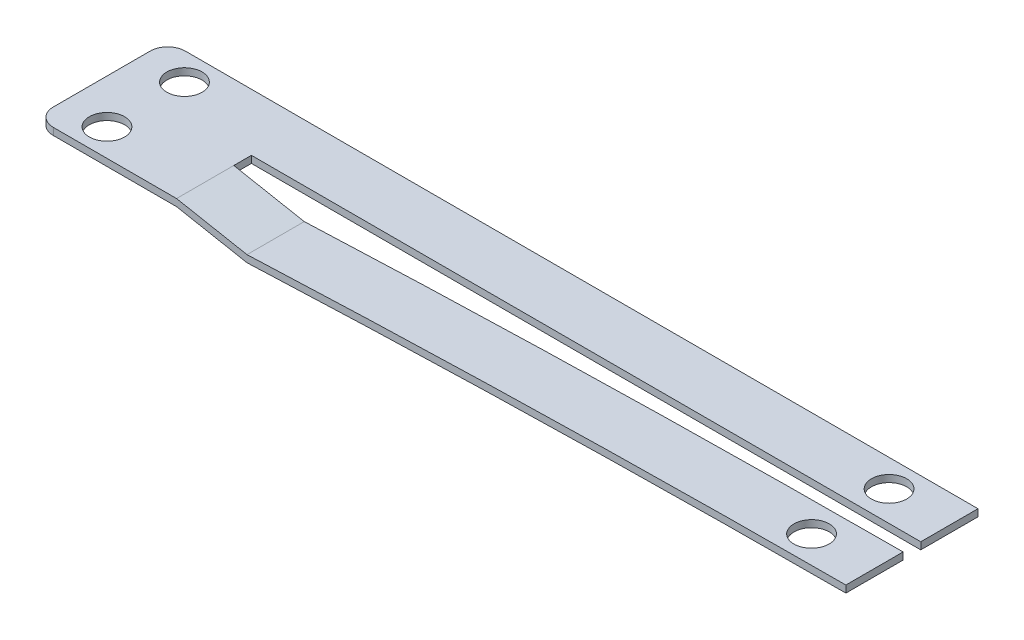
ISO-10303-21;
HEADER;
FILE_DESCRIPTION(('STEP AP214'),'2;1');
FILE_NAME('part.step','',(''),(''),'','','');
FILE_SCHEMA(('AUTOMOTIVE_DESIGN { 1 0 10303 214 1 1 1 1 }'));
ENDSEC;
DATA;
#1=APPLICATION_CONTEXT('core data for automotive mechanical design processes');
#2=APPLICATION_PROTOCOL_DEFINITION('international standard','automotive_design',2000,#1);
#3=PRODUCT_CONTEXT('',#1,'mechanical');
#4=PRODUCT('Part','Part','',(#3));
#5=PRODUCT_RELATED_PRODUCT_CATEGORY('part','',(#4));
#6=PRODUCT_DEFINITION_FORMATION('','',#4);
#7=PRODUCT_DEFINITION_CONTEXT('part definition',#1,'design');
#8=PRODUCT_DEFINITION('design','',#6,#7);
#9=PRODUCT_DEFINITION_SHAPE('','',#8);
#10=(LENGTH_UNIT() NAMED_UNIT(*) SI_UNIT(.MILLI.,.METRE.));
#11=(NAMED_UNIT(*) PLANE_ANGLE_UNIT() SI_UNIT($,.RADIAN.));
#12=(NAMED_UNIT(*) SI_UNIT($,.STERADIAN.) SOLID_ANGLE_UNIT());
#13=UNCERTAINTY_MEASURE_WITH_UNIT(LENGTH_MEASURE(1.E-05),#10,'distance_accuracy_value','');
#14=(GEOMETRIC_REPRESENTATION_CONTEXT(3) GLOBAL_UNCERTAINTY_ASSIGNED_CONTEXT((#13)) GLOBAL_UNIT_ASSIGNED_CONTEXT((#10,
#11,#12)) REPRESENTATION_CONTEXT('',''));
#15=CARTESIAN_POINT('',(0.,0.,0.));
#16=DIRECTION('',(0.,0.,1.));
#17=DIRECTION('',(1.,0.,0.));
#18=AXIS2_PLACEMENT_3D('',#15,#16,#17);
#19=CARTESIAN_POINT('',(5.16176470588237,-0.759074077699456,-7.39558823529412));
#20=DIRECTION('',(0.,1.,0.));
#21=DIRECTION('',(0.,0.,1.));
#22=AXIS2_PLACEMENT_3D('',#19,#20,#21);
#23=CYLINDRICAL_SURFACE('',#22,0.999999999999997);
#24=CARTESIAN_POINT('',(5.16176470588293,-0.0137757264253,-8.39558823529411));
#25=CARTESIAN_POINT('',(5.21790328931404,-0.0134365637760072,-8.39558361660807));
#26=CARTESIAN_POINT('',(5.27409285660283,-0.0131028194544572,-8.39084352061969));
#27=CARTESIAN_POINT('',(5.38497289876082,-0.012455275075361,-8.371985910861));
#28=CARTESIAN_POINT('',(5.43965990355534,-0.0121415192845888,-8.35784832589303));
#29=CARTESIAN_POINT('',(5.54584306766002,-0.0115422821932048,-8.32059892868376));
#30=CARTESIAN_POINT('',(5.5973418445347,-0.0112567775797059,-8.29749459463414));
#31=CARTESIAN_POINT('',(5.69570309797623,-0.0107198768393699,-8.24297877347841));
#32=CARTESIAN_POINT('',(5.74256775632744,-0.0104684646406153,-8.211571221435));
#33=CARTESIAN_POINT('',(5.83036917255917,-0.0100039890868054,-8.14132893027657));
#34=CARTESIAN_POINT('',(5.87130484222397,-0.00979093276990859,-8.10249283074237));
#35=CARTESIAN_POINT('',(5.94607853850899,-0.00940637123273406,-8.01849577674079));
#36=CARTESIAN_POINT('',(5.97991595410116,-0.0092348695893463,-7.97333427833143));
#37=CARTESIAN_POINT('',(6.03952660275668,-0.00893553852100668,-7.87797360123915));
#38=CARTESIAN_POINT('',(6.06530025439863,-0.00880770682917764,-7.82777468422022));
#39=CARTESIAN_POINT('',(6.10805378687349,-0.00859698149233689,-7.72376277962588));
#40=CARTESIAN_POINT('',(6.12503376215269,-0.00851408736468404,-7.66994983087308));
#41=CARTESIAN_POINT('',(6.1497182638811,-0.00839392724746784,-7.56023724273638));
#42=CARTESIAN_POINT('',(6.15742283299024,-0.00835666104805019,-7.50433761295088));
#43=CARTESIAN_POINT('',(6.16333793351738,-0.00832803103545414,-7.39203826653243));
#44=CARTESIAN_POINT('',(6.1615484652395,-0.00833666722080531,-7.33563854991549));
#45=CARTESIAN_POINT('',(6.14852636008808,-0.00839977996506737,-7.22394059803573));
#46=CARTESIAN_POINT('',(6.13729381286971,-0.0084542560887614,-7.16864235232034));
#47=CARTESIAN_POINT('',(6.10570436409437,-0.00860863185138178,-7.06071594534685));
#48=CARTESIAN_POINT('',(6.08534736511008,-0.00870853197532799,-7.00808781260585));
#49=CARTESIAN_POINT('',(6.03608596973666,-0.00895287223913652,-6.90699420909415));
#50=CARTESIAN_POINT('',(6.00718123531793,-0.00909731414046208,-6.85852890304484));
#51=CARTESIAN_POINT('',(5.9416479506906,-0.00942916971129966,-6.76714310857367));
#52=CARTESIAN_POINT('',(5.90502006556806,-0.00961657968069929,-6.72422214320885));
#53=CARTESIAN_POINT('',(5.82508683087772,-0.0100318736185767,-6.64514569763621));
#54=CARTESIAN_POINT('',(5.78178272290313,-0.010259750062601,-6.60898896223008));
#55=CARTESIAN_POINT('',(5.68969649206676,-0.0107525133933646,-6.54444172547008));
#56=CARTESIAN_POINT('',(5.64091178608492,-0.0110174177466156,-6.51605490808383));
#57=CARTESIAN_POINT('',(5.53923254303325,-0.0115793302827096,-6.46785542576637));
#58=CARTESIAN_POINT('',(5.48633456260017,-0.011876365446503,-6.44805003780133));
#59=CARTESIAN_POINT('',(5.37805141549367,-0.0124953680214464,-6.41764617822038));
#60=CARTESIAN_POINT('',(5.32267180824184,-0.0128172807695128,-6.4070281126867));
#61=CARTESIAN_POINT('',(5.23194154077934,-0.0133539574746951,-6.39743349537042));
#62=CARTESIAN_POINT('',(5.19686307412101,-0.013563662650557,-6.39558534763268));
#63=CARTESIAN_POINT('',(5.10562560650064,-0.0141149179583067,-6.39559285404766));
#64=CARTESIAN_POINT('',(5.04943559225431,-0.0144601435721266,-6.4003330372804));
#65=CARTESIAN_POINT('',(4.93855481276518,-0.0151524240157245,-6.41919092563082));
#66=CARTESIAN_POINT('',(4.88386751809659,-0.0154994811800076,-6.43332870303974));
#67=CARTESIAN_POINT('',(4.7776839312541,-0.0161833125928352,-6.47057852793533));
#68=CARTESIAN_POINT('',(4.72618502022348,-0.0165200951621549,-6.49368309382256));
#69=CARTESIAN_POINT('',(4.62782358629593,-0.0171717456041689,-6.5481994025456));
#70=CARTESIAN_POINT('',(4.58095888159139,-0.0174866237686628,-6.57960721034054));
#71=CARTESIAN_POINT('',(4.49315719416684,-0.0180831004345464,-6.64985023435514));
#72=CARTESIAN_POINT('',(4.45222133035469,-0.0183646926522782,-6.68868684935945));
#73=CARTESIAN_POINT('',(4.37744736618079,-0.0188836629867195,-6.77268506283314));
#74=CARTESIAN_POINT('',(4.3436098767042,-0.019121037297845,-6.81784720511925));
#75=CARTESIAN_POINT('',(4.28399940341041,-0.0195420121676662,-6.91320903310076));
#76=CARTESIAN_POINT('',(4.25822595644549,-0.0197256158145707,-6.9634084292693));
#77=CARTESIAN_POINT('',(4.21547294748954,-0.0200315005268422,-7.06742134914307));
#78=CARTESIAN_POINT('',(4.19849329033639,-0.0201537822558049,-7.12123483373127));
#79=CARTESIAN_POINT('',(4.17380974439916,-0.0203318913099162,-7.23094775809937));
#80=CARTESIAN_POINT('',(4.16610568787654,-0.0203877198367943,-7.286847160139));
#81=CARTESIAN_POINT('',(4.1601915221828,-0.0204305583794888,-7.39914598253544));
#82=CARTESIAN_POINT('',(4.16198141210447,-0.0204175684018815,-7.45554540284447));
#83=CARTESIAN_POINT('',(4.17500419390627,-0.0203233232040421,-7.56724218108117));
#84=CARTESIAN_POINT('',(4.18623691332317,-0.0202420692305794,-7.62253955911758));
#85=CARTESIAN_POINT('',(4.21782640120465,-0.020014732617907,-7.73046419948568));
#86=CARTESIAN_POINT('',(4.23818326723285,-0.0198686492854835,-7.78309143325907));
#87=CARTESIAN_POINT('',(4.28744417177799,-0.0195177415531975,-7.8841834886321));
#88=CARTESIAN_POINT('',(4.31634858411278,-0.0193129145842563,-7.93264812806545));
#89=CARTESIAN_POINT('',(4.38188096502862,-0.018852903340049,-8.02403267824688));
#90=CARTESIAN_POINT('',(4.41850826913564,-0.0185977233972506,-8.06695306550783));
#91=CARTESIAN_POINT('',(4.49844065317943,-0.0180471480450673,-8.1460290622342));
#92=CARTESIAN_POINT('',(4.54174457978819,-0.017751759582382,-8.18218583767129));
#93=CARTESIAN_POINT('',(4.63383044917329,-0.0171317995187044,-8.24673320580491));
#94=CARTESIAN_POINT('',(4.68261497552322,-0.0168072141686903,-8.27512011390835));
#95=CARTESIAN_POINT('',(4.78429442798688,-0.0161404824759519,-8.32332008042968));
#96=CARTESIAN_POINT('',(4.83719283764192,-0.0157983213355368,-8.34312577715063));
#97=CARTESIAN_POINT('',(4.94547700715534,-0.0151088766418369,-8.37353010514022));
#98=CARTESIAN_POINT('',(5.00085720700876,-0.0147616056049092,-8.38414833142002));
#99=CARTESIAN_POINT('',(5.09158802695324,-0.0142019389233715,-8.39374298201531));
#100=CARTESIAN_POINT('',(5.12666640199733,-0.0139877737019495,-8.3955911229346));
#101=CARTESIAN_POINT('',(5.16176470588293,-0.0137757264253,-8.39558823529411));
#102=B_SPLINE_CURVE_WITH_KNOTS('',3,(#24,#25,#26,#27,#28,#29,#30,#31,#32,#33,#34,#35,#36,#37,
#38,#39,#40,#41,#42,#43,#44,#45,#46,#47,#48,#49,#50,#51,#52,#53,#54,#55,#56,#57,#58,#59,#60,#61,
#62,#63,#64,#65,#66,#67,#68,#69,#70,#71,#72,#73,#74,#75,#76,#77,#78,#79,#80,#81,#82,#83,#84,#85,
#86,#87,#88,#89,#90,#91,#92,#93,#94,#95,#96,#97,#98,#99,#100,#101),.UNSPECIFIED.,.T.,.F.,(4,2,2,
2,2,2,2,2,2,2,2,2,2,2,2,2,2,2,2,2,2,2,2,2,2,2,2,2,2,2,2,2,2,2,2,2,2,2,4),(0.,0.16830879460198,
0.336978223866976,0.505507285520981,0.673956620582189,0.842436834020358,1.01093154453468,
1.1794175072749,1.34790166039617,1.5163850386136,1.68486841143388,1.85335018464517,
2.02183375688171,2.19032399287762,2.35879972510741,2.52724416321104,2.69576832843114,
2.86443512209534,3.0327413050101,3.13796953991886,3.30627988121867,3.4749508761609,
3.64348143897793,3.8119322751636,3.98041486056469,4.14891193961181,4.31739933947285,
4.48588491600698,4.65436744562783,4.82284995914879,4.99132939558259,5.15981063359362,
5.32829924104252,5.49677335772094,5.66521840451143,5.83374319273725,6.00241227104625,
6.17072071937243,6.27594876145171),.UNSPECIFIED.);
#103=CARTESIAN_POINT('',(5.16176470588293,-0.0137757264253,-8.39558823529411));
#104=VERTEX_POINT('',#103);
#105=EDGE_CURVE('E141',#104,#104,#102,.T.);
#106=ORIENTED_EDGE('',*,*,#105,.T.);
#107=EDGE_LOOP('',(#106));
#108=FACE_BOUND('',#107,.T.);
#109=CARTESIAN_POINT('',(5.16176470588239,0.386224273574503,-6.39558823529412));
#110=CARTESIAN_POINT('',(5.10562560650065,0.385885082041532,-6.39559285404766));
#111=CARTESIAN_POINT('',(5.04943559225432,0.385539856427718,-6.4003330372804));
#112=CARTESIAN_POINT('',(4.93855481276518,0.384847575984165,-6.41919092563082));
#113=CARTESIAN_POINT('',(4.88386751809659,0.384500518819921,-6.43332870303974));
#114=CARTESIAN_POINT('',(4.7776839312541,0.383816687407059,-6.47057852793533));
#115=CARTESIAN_POINT('',(4.72618502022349,0.383479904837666,-6.49368309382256));
#116=CARTESIAN_POINT('',(4.62782358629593,0.382828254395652,-6.54819940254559));
#117=CARTESIAN_POINT('',(4.58095888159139,0.382513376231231,-6.57960721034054));
#118=CARTESIAN_POINT('',(4.49315719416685,0.381916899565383,-6.64985023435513));
#119=CARTESIAN_POINT('',(4.45222133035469,0.381635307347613,-6.68868684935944));
#120=CARTESIAN_POINT('',(4.37744736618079,0.381116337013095,-6.77268506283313));
#121=CARTESIAN_POINT('',(4.34360987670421,0.380878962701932,-6.81784720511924));
#122=CARTESIAN_POINT('',(4.28399940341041,0.380457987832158,-6.91320903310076));
#123=CARTESIAN_POINT('',(4.25822595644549,0.380274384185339,-6.9634084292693));
#124=CARTESIAN_POINT('',(4.21547294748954,0.379968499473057,-7.06742134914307));
#125=CARTESIAN_POINT('',(4.19849329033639,0.379846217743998,-7.12123483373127));
#126=CARTESIAN_POINT('',(4.17380974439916,0.379668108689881,-7.23094775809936));
#127=CARTESIAN_POINT('',(4.16610568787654,0.379612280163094,-7.28684716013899));
#128=CARTESIAN_POINT('',(4.1601915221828,0.379569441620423,-7.39914598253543));
#129=CARTESIAN_POINT('',(4.16198141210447,0.379582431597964,-7.45554540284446));
#130=CARTESIAN_POINT('',(4.17500419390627,0.379676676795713,-7.56724218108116));
#131=CARTESIAN_POINT('',(4.18623691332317,0.379757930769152,-7.62253955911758));
#132=CARTESIAN_POINT('',(4.21782640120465,0.379985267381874,-7.73046419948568));
#133=CARTESIAN_POINT('',(4.23818326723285,0.380131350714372,-7.78309143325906));
#134=CARTESIAN_POINT('',(4.28744417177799,0.38048225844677,-7.88418348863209));
#135=CARTESIAN_POINT('',(4.31634858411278,0.380687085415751,-7.93264812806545));
#136=CARTESIAN_POINT('',(4.38188096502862,0.381147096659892,-8.02403267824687));
#137=CARTESIAN_POINT('',(4.41850826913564,0.381402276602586,-8.06695306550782));
#138=CARTESIAN_POINT('',(4.49844065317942,0.381952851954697,-8.1460290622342));
#139=CARTESIAN_POINT('',(4.54174457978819,0.382248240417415,-8.18218583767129));
#140=CARTESIAN_POINT('',(4.63383044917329,0.382868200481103,-8.2467332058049));
#141=CARTESIAN_POINT('',(4.68261497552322,0.383192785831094,-8.27512011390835));
#142=CARTESIAN_POINT('',(4.78429442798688,0.383859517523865,-8.32332008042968));
#143=CARTESIAN_POINT('',(4.83719283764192,0.384201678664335,-8.34312577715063));
#144=CARTESIAN_POINT('',(4.94547700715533,0.384891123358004,-8.37353010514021));
#145=CARTESIAN_POINT('',(5.00085720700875,0.385238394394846,-8.38414833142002));
#146=CARTESIAN_POINT('',(5.09158802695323,0.385798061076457,-8.39374298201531));
#147=CARTESIAN_POINT('',(5.12666640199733,0.386012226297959,-8.3955911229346));
#148=CARTESIAN_POINT('',(5.21790328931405,0.386563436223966,-8.39558361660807));
#149=CARTESIAN_POINT('',(5.27409285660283,0.386897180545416,-8.39084352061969));
#150=CARTESIAN_POINT('',(5.38497289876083,0.387544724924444,-8.371985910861));
#151=CARTESIAN_POINT('',(5.43965990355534,0.387858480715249,-8.35784832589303));
#152=CARTESIAN_POINT('',(5.54584306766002,0.388457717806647,-8.32059892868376));
#153=CARTESIAN_POINT('',(5.5973418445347,0.388743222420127,-8.29749459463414));
#154=CARTESIAN_POINT('',(5.69570309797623,0.389280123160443,-8.24297877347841));
#155=CARTESIAN_POINT('',(5.74256775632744,0.389531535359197,-8.211571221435));
#156=CARTESIAN_POINT('',(5.83036917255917,0.389996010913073,-8.14132893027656));
#157=CARTESIAN_POINT('',(5.87130484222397,0.390209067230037,-8.10249283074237));
#158=CARTESIAN_POINT('',(5.94607853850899,0.390593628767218,-8.01849577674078));
#159=CARTESIAN_POINT('',(5.97991595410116,0.390765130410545,-7.97333427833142));
#160=CARTESIAN_POINT('',(6.03952660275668,0.391064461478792,-7.87797360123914));
#161=CARTESIAN_POINT('',(6.06530025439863,0.391192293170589,-7.82777468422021));
#162=CARTESIAN_POINT('',(6.10805378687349,0.391403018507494,-7.72376277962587));
#163=CARTESIAN_POINT('',(6.12503376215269,0.391485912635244,-7.66994983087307));
#164=CARTESIAN_POINT('',(6.14971826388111,0.391606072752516,-7.56023724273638));
#165=CARTESIAN_POINT('',(6.15742283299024,0.391643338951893,-7.50433761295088));
#166=CARTESIAN_POINT('',(6.16333793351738,0.391671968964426,-7.39203826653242));
#167=CARTESIAN_POINT('',(6.1615484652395,0.391663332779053,-7.33563854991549));
#168=CARTESIAN_POINT('',(6.14852636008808,0.391600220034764,-7.22394059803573));
#169=CARTESIAN_POINT('',(6.13729381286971,0.391545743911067,-7.16864235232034));
#170=CARTESIAN_POINT('',(6.10570436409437,0.391391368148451,-7.06071594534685));
#171=CARTESIAN_POINT('',(6.08534736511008,0.391291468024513,-7.00808781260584));
#172=CARTESIAN_POINT('',(6.03608596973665,0.391047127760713,-6.90699420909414));
#173=CARTESIAN_POINT('',(6.00718123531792,0.390902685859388,-6.85852890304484));
#174=CARTESIAN_POINT('',(5.9416479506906,0.390570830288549,-6.76714310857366));
#175=CARTESIAN_POINT('',(5.90502006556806,0.390383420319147,-6.72422214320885));
#176=CARTESIAN_POINT('',(5.82508683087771,0.389968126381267,-6.64514569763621));
#177=CARTESIAN_POINT('',(5.78178272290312,0.389740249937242,-6.60898896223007));
#178=CARTESIAN_POINT('',(5.68969649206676,0.389247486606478,-6.54444172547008));
#179=CARTESIAN_POINT('',(5.64091178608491,0.388982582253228,-6.51605490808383));
#180=CARTESIAN_POINT('',(5.53923254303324,0.388420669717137,-6.46785542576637));
#181=CARTESIAN_POINT('',(5.48633456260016,0.388123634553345,-6.44805003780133));
#182=CARTESIAN_POINT('',(5.37805141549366,0.387504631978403,-6.41764617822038));
#183=CARTESIAN_POINT('',(5.32267180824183,0.387182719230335,-6.4070281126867));
#184=CARTESIAN_POINT('',(5.23194154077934,0.386646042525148,-6.39743349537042));
#185=CARTESIAN_POINT('',(5.19686307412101,0.386436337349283,-6.39558534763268));
#186=CARTESIAN_POINT('',(5.16176470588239,0.386224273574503,-6.39558823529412));
#187=B_SPLINE_CURVE_WITH_KNOTS('',3,(#109,#110,#111,#112,#113,#114,#115,#116,#117,#118,#119,
#120,#121,#122,#123,#124,#125,#126,#127,#128,#129,#130,#131,#132,#133,#134,#135,#136,#137,#138,
#139,#140,#141,#142,#143,#144,#145,#146,#147,#148,#149,#150,#151,#152,#153,#154,#155,#156,#157,
#158,#159,#160,#161,#162,#163,#164,#165,#166,#167,#168,#169,#170,#171,#172,#173,#174,#175,#176,
#177,#178,#179,#180,#181,#182,#183,#184,#185,#186),.UNSPECIFIED.,.T.,.F.,(4,2,2,2,2,2,2,2,2,2,2,
2,2,2,2,2,2,2,2,2,2,2,2,2,2,2,2,2,2,2,2,2,2,2,2,2,2,2,4),(0.,0.168310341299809,
0.336981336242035,0.505511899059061,0.67396273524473,0.842445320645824,1.01094239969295,
1.17942979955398,1.34791537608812,1.51639790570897,1.68488041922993,1.85335985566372,
2.02184109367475,2.19032970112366,2.35880381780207,2.52724886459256,2.69577365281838,
2.86444273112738,3.03275117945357,3.13797922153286,3.30628801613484,3.47495744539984,
3.64348650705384,3.81193584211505,3.98041605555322,4.14891076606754,4.31739672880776,
4.48588088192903,4.65436426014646,4.82284763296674,4.99132940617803,5.15981297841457,
5.32830321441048,5.49677894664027,5.6652233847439,5.833747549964,6.0024143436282,
6.17072052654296,6.27594876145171),.UNSPECIFIED.);
#188=CARTESIAN_POINT('',(5.16176470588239,0.386224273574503,-6.39558823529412));
#189=VERTEX_POINT('',#188);
#190=EDGE_CURVE('E21',#189,#189,#187,.T.);
#191=ORIENTED_EDGE('',*,*,#190,.F.);
#192=EDGE_LOOP('',(#191));
#193=FACE_BOUND('',#192,.T.);
#194=ADVANCED_FACE('F17',(#108,#193),#23,.F.);
#195=CARTESIAN_POINT('',(8.66176470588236,0.4,-9.09558823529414));
#196=DIRECTION('',(1.,0.,0.));
#197=DIRECTION('',(0.,1.,0.));
#198=AXIS2_PLACEMENT_3D('',#195,#196,#197);
#199=PLANE('',#198);
#200=DIRECTION('',(0.,1.,0.));
#201=VECTOR('',#200,1.);
#202=CARTESIAN_POINT('',(8.66176470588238,-830.651891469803,-9.09558823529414));
#203=LINE('',#202,#201);
#204=CARTESIAN_POINT('',(8.66176470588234,0.399999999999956,-9.09558823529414));
#205=VERTEX_POINT('',#204);
#206=CARTESIAN_POINT('',(8.66176470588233,1.66533453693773E-13,-9.09558823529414));
#207=VERTEX_POINT('',#206);
#208=EDGE_CURVE('E128',#205,#207,#203,.F.);
#209=ORIENTED_EDGE('',*,*,#208,.F.);
#210=DIRECTION('',(0.,0.,1.));
#211=VECTOR('',#210,1.);
#212=CARTESIAN_POINT('',(8.6617647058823,0.399999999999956,-9.09558823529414));
#213=LINE('',#212,#211);
#214=CARTESIAN_POINT('',(8.66176470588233,0.399999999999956,-5.84558823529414));
#215=VERTEX_POINT('',#214);
#216=EDGE_CURVE('E116',#215,#205,#213,.F.);
#217=ORIENTED_EDGE('',*,*,#216,.F.);
#218=DIRECTION('',(0.,1.,0.));
#219=VECTOR('',#218,1.);
#220=CARTESIAN_POINT('',(8.66176470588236,0.4,-5.84558823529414));
#221=LINE('',#220,#219);
#222=CARTESIAN_POINT('',(8.66176470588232,1.66533453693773E-13,-5.84558823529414));
#223=VERTEX_POINT('',#222);
#224=EDGE_CURVE('E135',#215,#223,#221,.F.);
#225=ORIENTED_EDGE('',*,*,#224,.T.);
#226=DIRECTION('',(0.,0.,1.));
#227=VECTOR('',#226,1.);
#228=CARTESIAN_POINT('',(8.66176470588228,1.11022302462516E-13,-9.09558823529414));
#229=LINE('',#228,#227);
#230=EDGE_CURVE('E131',#223,#207,#229,.F.);
#231=ORIENTED_EDGE('',*,*,#230,.T.);
#232=EDGE_LOOP('',(#209,#217,#225,#231));
#233=FACE_BOUND('',#232,.T.);
#234=ADVANCED_FACE('F129',(#233),#199,.T.);
#235=CARTESIAN_POINT('',(10.1826928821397,-830.651891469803,-9.09558823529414));
#236=DIRECTION('',(0.,0.,-1.));
#237=DIRECTION('',(-1.,0.,0.));
#238=AXIS2_PLACEMENT_3D('',#235,#236,#237);
#239=PLANE('',#238);
#240=ORIENTED_EDGE('',*,*,#208,.T.);
#241=CARTESIAN_POINT('',(10.1826928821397,-831.051891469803,-9.09558823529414));
#242=DIRECTION('',(0.,0.,1.));
#243=DIRECTION('',(1.,0.,0.));
#244=AXIS2_PLACEMENT_3D('',#241,#242,#243);
#245=CIRCLE('',#244,831.053283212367);
#246=CARTESIAN_POINT('',(-25.3382352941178,-0.758074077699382,-9.09558823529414));
#247=VERTEX_POINT('',#246);
#248=EDGE_CURVE('E149',#207,#247,#245,.T.);
#249=ORIENTED_EDGE('',*,*,#248,.T.);
#250=DIRECTION('',(0.982511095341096,-0.186204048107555,0.));
#251=VECTOR('',#250,1.);
#252=CARTESIAN_POINT('',(-25.3382352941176,-0.758074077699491,-9.09558823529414));
#253=LINE('',#252,#251);
#254=CARTESIAN_POINT('',(-29.3382352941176,0.,-9.09558823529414));
#255=VERTEX_POINT('',#254);
#256=EDGE_CURVE('E330',#255,#247,#253,.T.);
#257=ORIENTED_EDGE('',*,*,#256,.F.);
#258=DIRECTION('',(0.,1.,0.));
#259=VECTOR('',#258,1.);
#260=CARTESIAN_POINT('',(-29.3382352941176,0.4,-9.09558823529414));
#261=LINE('',#260,#259);
#262=CARTESIAN_POINT('',(-29.3382352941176,0.4,-9.09558823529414));
#263=VERTEX_POINT('',#262);
#264=EDGE_CURVE('E286',#255,#263,#261,.T.);
#265=ORIENTED_EDGE('',*,*,#264,.T.);
#266=DIRECTION('',(-0.982511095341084,0.186204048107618,0.));
#267=VECTOR('',#266,1.);
#268=CARTESIAN_POINT('',(-29.3382352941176,0.4,-9.09558823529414));
#269=LINE('',#268,#267);
#270=CARTESIAN_POINT('',(-25.3382352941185,-0.358074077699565,-9.09558823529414));
#271=VERTEX_POINT('',#270);
#272=EDGE_CURVE('E140',#271,#263,#269,.T.);
#273=ORIENTED_EDGE('',*,*,#272,.F.);
#274=CARTESIAN_POINT('',(10.1826928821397,-830.651891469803,-9.09558823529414));
#275=DIRECTION('',(0.,0.,1.));
#276=DIRECTION('',(1.,0.,0.));
#277=AXIS2_PLACEMENT_3D('',#274,#275,#276);
#278=CIRCLE('',#277,831.053283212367);
#279=EDGE_CURVE('E121',#205,#271,#278,.T.);
#280=ORIENTED_EDGE('',*,*,#279,.F.);
#281=EDGE_LOOP('',(#240,#249,#257,#265,#273,#280));
#282=FACE_BOUND('',#281,.T.);
#283=ADVANCED_FACE('F138',(#282),#239,.T.);
#284=CARTESIAN_POINT('',(10.1826928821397,-830.651891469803,-9.09558823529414));
#285=DIRECTION('',(0.,0.,1.));
#286=DIRECTION('',(1.,0.,0.));
#287=AXIS2_PLACEMENT_3D('',#284,#285,#286);
#288=CYLINDRICAL_SURFACE('',#287,831.053283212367);
#289=ORIENTED_EDGE('',*,*,#279,.T.);
#290=DIRECTION('',(0.,0.,1.));
#291=VECTOR('',#290,1.);
#292=CARTESIAN_POINT('',(-25.3382352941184,-0.35807407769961,-9.09558823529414));
#293=LINE('',#292,#291);
#294=CARTESIAN_POINT('',(-25.3382352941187,-0.358074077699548,-5.84558823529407));
#295=VERTEX_POINT('',#294);
#296=EDGE_CURVE('E266',#295,#271,#293,.F.);
#297=ORIENTED_EDGE('',*,*,#296,.F.);
#298=CARTESIAN_POINT('',(10.1826928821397,-830.651891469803,-5.84558823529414));
#299=DIRECTION('',(0.,0.,1.));
#300=DIRECTION('',(1.,0.,0.));
#301=AXIS2_PLACEMENT_3D('',#298,#299,#300);
#302=CIRCLE('',#301,831.053283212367);
#303=EDGE_CURVE('E124',#295,#215,#302,.F.);
#304=ORIENTED_EDGE('',*,*,#303,.T.);
#305=ORIENTED_EDGE('',*,*,#216,.T.);
#306=EDGE_LOOP('',(#289,#297,#304,#305));
#307=FACE_BOUND('',#306,.T.);
#308=ORIENTED_EDGE('',*,*,#190,.T.);
#309=EDGE_LOOP('',(#308));
#310=FACE_BOUND('',#309,.T.);
#311=ADVANCED_FACE('F118',(#307,#310),#288,.T.);
#312=CARTESIAN_POINT('',(10.1826928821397,-831.051891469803,-9.09558823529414));
#313=DIRECTION('',(0.,0.,1.));
#314=DIRECTION('',(1.,0.,0.));
#315=AXIS2_PLACEMENT_3D('',#312,#313,#314);
#316=CYLINDRICAL_SURFACE('',#315,831.053283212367);
#317=DIRECTION('',(0.,0.,1.));
#318=VECTOR('',#317,1.);
#319=CARTESIAN_POINT('',(-25.3382352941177,-0.758074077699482,-9.09558823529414));
#320=LINE('',#319,#318);
#321=CARTESIAN_POINT('',(-25.3382352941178,-0.758074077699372,-5.84558823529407));
#322=VERTEX_POINT('',#321);
#323=EDGE_CURVE('E326',#247,#322,#320,.T.);
#324=ORIENTED_EDGE('',*,*,#323,.F.);
#325=ORIENTED_EDGE('',*,*,#248,.F.);
#326=ORIENTED_EDGE('',*,*,#230,.F.);
#327=CARTESIAN_POINT('',(10.1826928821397,-831.051891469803,-5.84558823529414));
#328=DIRECTION('',(0.,0.,1.));
#329=DIRECTION('',(1.,0.,0.));
#330=AXIS2_PLACEMENT_3D('',#327,#328,#329);
#331=CIRCLE('',#330,831.053283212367);
#332=EDGE_CURVE('E259',#223,#322,#331,.T.);
#333=ORIENTED_EDGE('',*,*,#332,.T.);
#334=EDGE_LOOP('',(#324,#325,#326,#333));
#335=FACE_BOUND('',#334,.T.);
#336=ORIENTED_EDGE('',*,*,#105,.F.);
#337=EDGE_LOOP('',(#336));
#338=FACE_BOUND('',#337,.T.);
#339=ADVANCED_FACE('F151',(#335,#338),#316,.F.);
#340=CARTESIAN_POINT('',(-25.3382352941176,-0.758074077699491,-9.09558823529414));
#341=DIRECTION('',(-0.186204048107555,-0.982511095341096,0.));
#342=DIRECTION('',(0.982511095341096,-0.186204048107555,0.));
#343=AXIS2_PLACEMENT_3D('',#340,#341,#342);
#344=PLANE('',#343);
#345=ORIENTED_EDGE('',*,*,#256,.T.);
#346=ORIENTED_EDGE('',*,*,#323,.T.);
#347=DIRECTION('',(-0.982511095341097,0.186204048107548,0.));
#348=VECTOR('',#347,1.);
#349=CARTESIAN_POINT('',(-25.3382352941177,-0.758074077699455,-5.84558823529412));
#350=LINE('',#349,#348);
#351=CARTESIAN_POINT('',(-29.3382352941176,0.,-5.84558823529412));
#352=VERTEX_POINT('',#351);
#353=EDGE_CURVE('E261',#322,#352,#350,.T.);
#354=ORIENTED_EDGE('',*,*,#353,.T.);
#355=DIRECTION('',(0.,0.,-1.));
#356=VECTOR('',#355,1.);
#357=CARTESIAN_POINT('',(-29.3382352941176,0.,-6.84558823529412));
#358=LINE('',#357,#356);
#359=EDGE_CURVE('E316',#255,#352,#358,.F.);
#360=ORIENTED_EDGE('',*,*,#359,.F.);
#361=EDGE_LOOP('',(#345,#346,#354,#360));
#362=FACE_BOUND('',#361,.T.);
#363=ADVANCED_FACE('F155',(#362),#344,.T.);
#364=CARTESIAN_POINT('',(-36.3382352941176,0.,-6.84558823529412));
#365=DIRECTION('',(0.,-1.,0.));
#366=DIRECTION('',(0.,0.,-1.));
#367=AXIS2_PLACEMENT_3D('',#364,#365,#366);
#368=PLANE('',#367);
#369=CARTESIAN_POINT('',(5.16176470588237,0.,-11.7955882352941));
#370=DIRECTION('',(0.,-1.,0.));
#371=DIRECTION('',(0.,0.,-1.));
#372=AXIS2_PLACEMENT_3D('',#369,#370,#371);
#373=CIRCLE('',#372,0.999999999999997);
#374=CARTESIAN_POINT('',(5.16176470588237,0.,-12.7955882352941));
#375=VERTEX_POINT('',#374);
#376=EDGE_CURVE('E233',#375,#375,#373,.F.);
#377=ORIENTED_EDGE('',*,*,#376,.T.);
#378=EDGE_LOOP('',(#377));
#379=FACE_BOUND('',#378,.T.);
#380=CARTESIAN_POINT('',(-34.8382352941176,0.,-11.7955882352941));
#381=DIRECTION('',(0.,-1.,0.));
#382=DIRECTION('',(0.,0.,-1.));
#383=AXIS2_PLACEMENT_3D('',#380,#381,#382);
#384=CIRCLE('',#383,0.999999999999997);
#385=CARTESIAN_POINT('',(-34.8382352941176,0.,-12.7955882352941));
#386=VERTEX_POINT('',#385);
#387=EDGE_CURVE('E237',#386,#386,#384,.F.);
#388=ORIENTED_EDGE('',*,*,#387,.T.);
#389=EDGE_LOOP('',(#388));
#390=FACE_BOUND('',#389,.T.);
#391=CARTESIAN_POINT('',(-36.3382352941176,0.,-12.3455882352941));
#392=DIRECTION('',(0.,-1.,0.));
#393=DIRECTION('',(0.,0.,-1.));
#394=AXIS2_PLACEMENT_3D('',#391,#392,#393);
#395=CIRCLE('',#394,0.999999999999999);
#396=CARTESIAN_POINT('',(-36.3382352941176,0.,-13.3455882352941));
#397=VERTEX_POINT('',#396);
#398=CARTESIAN_POINT('',(-37.3382352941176,0.,-12.3455882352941));
#399=VERTEX_POINT('',#398);
#400=EDGE_CURVE('E240',#397,#399,#395,.F.);
#401=ORIENTED_EDGE('',*,*,#400,.F.);
#402=DIRECTION('',(1.,0.,0.));
#403=VECTOR('',#402,1.);
#404=CARTESIAN_POINT('',(-36.3382352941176,0.,-13.3455882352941));
#405=LINE('',#404,#403);
#406=CARTESIAN_POINT('',(8.66176470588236,0.,-13.3455882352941));
#407=VERTEX_POINT('',#406);
#408=EDGE_CURVE('E304',#397,#407,#405,.T.);
#409=ORIENTED_EDGE('',*,*,#408,.T.);
#410=DIRECTION('',(0.,0.,1.));
#411=VECTOR('',#410,1.);
#412=CARTESIAN_POINT('',(8.66176470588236,0.,-13.3455882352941));
#413=LINE('',#412,#411);
#414=CARTESIAN_POINT('',(8.66176470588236,0.,-10.0955882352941));
#415=VERTEX_POINT('',#414);
#416=EDGE_CURVE('E248',#407,#415,#413,.T.);
#417=ORIENTED_EDGE('',*,*,#416,.T.);
#418=DIRECTION('',(-1.,0.,0.));
#419=VECTOR('',#418,1.);
#420=CARTESIAN_POINT('',(8.66176470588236,0.,-10.0955882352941));
#421=LINE('',#420,#419);
#422=CARTESIAN_POINT('',(-29.3382352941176,0.,-10.0955882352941));
#423=VERTEX_POINT('',#422);
#424=EDGE_CURVE('E294',#415,#423,#421,.T.);
#425=ORIENTED_EDGE('',*,*,#424,.T.);
#426=DIRECTION('',(0.,0.,1.));
#427=VECTOR('',#426,1.);
#428=CARTESIAN_POINT('',(-29.3382352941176,0.,-10.0955882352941));
#429=LINE('',#428,#427);
#430=EDGE_CURVE('E288',#423,#255,#429,.T.);
#431=ORIENTED_EDGE('',*,*,#430,.T.);
#432=ORIENTED_EDGE('',*,*,#359,.T.);
#433=DIRECTION('',(-1.,0.,0.));
#434=VECTOR('',#433,1.);
#435=CARTESIAN_POINT('',(-29.3382352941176,0.,-5.84558823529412));
#436=LINE('',#435,#434);
#437=CARTESIAN_POINT('',(-36.3382352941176,0.,-5.84558823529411));
#438=VERTEX_POINT('',#437);
#439=EDGE_CURVE('E258',#352,#438,#436,.T.);
#440=ORIENTED_EDGE('',*,*,#439,.T.);
#441=CARTESIAN_POINT('',(-36.3382352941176,0.,-6.84558823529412));
#442=DIRECTION('',(0.,-1.,0.));
#443=DIRECTION('',(0.,0.,-1.));
#444=AXIS2_PLACEMENT_3D('',#441,#442,#443);
#445=CIRCLE('',#444,1.);
#446=CARTESIAN_POINT('',(-37.3382352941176,0.,-6.84558823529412));
#447=VERTEX_POINT('',#446);
#448=EDGE_CURVE('E255',#447,#438,#445,.F.);
#449=ORIENTED_EDGE('',*,*,#448,.F.);
#450=DIRECTION('',(0.,0.,-1.));
#451=VECTOR('',#450,1.);
#452=CARTESIAN_POINT('',(-37.3382352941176,0.,-6.84558823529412));
#453=LINE('',#452,#451);
#454=EDGE_CURVE('E254',#447,#399,#453,.T.);
#455=ORIENTED_EDGE('',*,*,#454,.T.);
#456=EDGE_LOOP('',(#401,#409,#417,#425,#431,#432,#440,#449,#455));
#457=FACE_BOUND('',#456,.T.);
#458=CARTESIAN_POINT('',(-34.8382352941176,0.,-7.39558823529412));
#459=DIRECTION('',(0.,-1.,0.));
#460=DIRECTION('',(0.,0.,-1.));
#461=AXIS2_PLACEMENT_3D('',#458,#459,#460);
#462=CIRCLE('',#461,0.999999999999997);
#463=CARTESIAN_POINT('',(-34.8382352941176,0.,-8.39558823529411));
#464=VERTEX_POINT('',#463);
#465=EDGE_CURVE('E244',#464,#464,#462,.F.);
#466=ORIENTED_EDGE('',*,*,#465,.T.);
#467=EDGE_LOOP('',(#466));
#468=FACE_BOUND('',#467,.T.);
#469=ADVANCED_FACE('F222',(#379,#390,#457,#468),#368,.T.);
#470=CARTESIAN_POINT('',(8.66176470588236,0.4,-10.0955882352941));
#471=DIRECTION('',(0.,0.,-1.));
#472=DIRECTION('',(-1.,0.,0.));
#473=AXIS2_PLACEMENT_3D('',#470,#471,#472);
#474=PLANE('',#473);
#475=DIRECTION('',(0.,1.,0.));
#476=VECTOR('',#475,1.);
#477=CARTESIAN_POINT('',(8.66176470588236,0.4,-10.0955882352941));
#478=LINE('',#477,#476);
#479=CARTESIAN_POINT('',(8.66176470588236,0.4,-10.0955882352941));
#480=VERTEX_POINT('',#479);
#481=EDGE_CURVE('E301',#415,#480,#478,.T.);
#482=ORIENTED_EDGE('',*,*,#481,.T.);
#483=DIRECTION('',(1.,0.,0.));
#484=VECTOR('',#483,1.);
#485=CARTESIAN_POINT('',(-36.3382352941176,0.4,-10.0955882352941));
#486=LINE('',#485,#484);
#487=CARTESIAN_POINT('',(-29.3382352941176,0.4,-10.0955882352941));
#488=VERTEX_POINT('',#487);
#489=EDGE_CURVE('E246',#480,#488,#486,.F.);
#490=ORIENTED_EDGE('',*,*,#489,.T.);
#491=DIRECTION('',(0.,1.,0.));
#492=VECTOR('',#491,1.);
#493=CARTESIAN_POINT('',(-29.3382352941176,0.4,-10.0955882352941));
#494=LINE('',#493,#492);
#495=EDGE_CURVE('E291',#488,#423,#494,.F.);
#496=ORIENTED_EDGE('',*,*,#495,.T.);
#497=ORIENTED_EDGE('',*,*,#424,.F.);
#498=EDGE_LOOP('',(#482,#490,#496,#497));
#499=FACE_BOUND('',#498,.T.);
#500=ADVANCED_FACE('F219',(#499),#474,.F.);
#501=CARTESIAN_POINT('',(-29.3382352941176,0.4,-10.0955882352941));
#502=DIRECTION('',(-1.,0.,0.));
#503=DIRECTION('',(0.,0.,1.));
#504=AXIS2_PLACEMENT_3D('',#501,#502,#503);
#505=PLANE('',#504);
#506=ORIENTED_EDGE('',*,*,#264,.F.);
#507=ORIENTED_EDGE('',*,*,#430,.F.);
#508=ORIENTED_EDGE('',*,*,#495,.F.);
#509=DIRECTION('',(0.,0.,-1.));
#510=VECTOR('',#509,1.);
#511=CARTESIAN_POINT('',(-29.3382352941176,0.4,-6.84558823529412));
#512=LINE('',#511,#510);
#513=EDGE_CURVE('E277',#488,#263,#512,.F.);
#514=ORIENTED_EDGE('',*,*,#513,.T.);
#515=EDGE_LOOP('',(#506,#507,#508,#514));
#516=FACE_BOUND('',#515,.T.);
#517=ADVANCED_FACE('F215',(#516),#505,.F.);
#518=CARTESIAN_POINT('',(-29.3382352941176,0.4,-9.09558823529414));
#519=DIRECTION('',(0.186204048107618,0.982511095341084,0.));
#520=DIRECTION('',(-0.982511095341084,0.186204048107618,0.));
#521=AXIS2_PLACEMENT_3D('',#518,#519,#520);
#522=PLANE('',#521);
#523=ORIENTED_EDGE('',*,*,#272,.T.);
#524=DIRECTION('',(0.,0.,-1.));
#525=VECTOR('',#524,1.);
#526=CARTESIAN_POINT('',(-29.3382352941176,0.4,-6.84558823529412));
#527=LINE('',#526,#525);
#528=CARTESIAN_POINT('',(-29.3382352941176,0.4,-5.84558823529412));
#529=VERTEX_POINT('',#528);
#530=EDGE_CURVE('E274',#263,#529,#527,.F.);
#531=ORIENTED_EDGE('',*,*,#530,.T.);
#532=DIRECTION('',(0.982511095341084,-0.186204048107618,0.));
#533=VECTOR('',#532,1.);
#534=CARTESIAN_POINT('',(-29.3382352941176,0.4,-5.84558823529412));
#535=LINE('',#534,#533);
#536=EDGE_CURVE('E262',#529,#295,#535,.T.);
#537=ORIENTED_EDGE('',*,*,#536,.T.);
#538=ORIENTED_EDGE('',*,*,#296,.T.);
#539=EDGE_LOOP('',(#523,#531,#537,#538));
#540=FACE_BOUND('',#539,.T.);
#541=ADVANCED_FACE('F211',(#540),#522,.T.);
#542=CARTESIAN_POINT('',(-29.3382352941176,0.4,-5.84558823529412));
#543=DIRECTION('',(0.,0.,-1.));
#544=DIRECTION('',(-1.,0.,0.));
#545=AXIS2_PLACEMENT_3D('',#542,#543,#544);
#546=PLANE('',#545);
#547=ORIENTED_EDGE('',*,*,#353,.F.);
#548=ORIENTED_EDGE('',*,*,#332,.F.);
#549=ORIENTED_EDGE('',*,*,#224,.F.);
#550=ORIENTED_EDGE('',*,*,#303,.F.);
#551=ORIENTED_EDGE('',*,*,#536,.F.);
#552=DIRECTION('',(1.,0.,0.));
#553=VECTOR('',#552,1.);
#554=CARTESIAN_POINT('',(-36.3382352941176,0.4,-5.84558823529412));
#555=LINE('',#554,#553);
#556=CARTESIAN_POINT('',(-36.3382352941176,0.4,-5.84558823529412));
#557=VERTEX_POINT('',#556);
#558=EDGE_CURVE('E276',#529,#557,#555,.F.);
#559=ORIENTED_EDGE('',*,*,#558,.T.);
#560=DIRECTION('',(0.,-1.,0.));
#561=VECTOR('',#560,1.);
#562=CARTESIAN_POINT('',(-36.3382352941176,0.4,-5.84558823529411));
#563=LINE('',#562,#561);
#564=EDGE_CURVE('E257',#438,#557,#563,.F.);
#565=ORIENTED_EDGE('',*,*,#564,.F.);
#566=ORIENTED_EDGE('',*,*,#439,.F.);
#567=EDGE_LOOP('',(#547,#548,#549,#550,#551,#559,#565,#566));
#568=FACE_BOUND('',#567,.T.);
#569=ADVANCED_FACE('F207',(#568),#546,.F.);
#570=CARTESIAN_POINT('',(-36.3382352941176,0.4,-6.84558823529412));
#571=DIRECTION('',(0.,-1.,0.));
#572=DIRECTION('',(0.,0.,-1.));
#573=AXIS2_PLACEMENT_3D('',#570,#571,#572);
#574=CYLINDRICAL_SURFACE('',#573,1.);
#575=CARTESIAN_POINT('',(-36.3382352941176,0.4,-6.84558823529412));
#576=DIRECTION('',(0.,-1.,0.));
#577=DIRECTION('',(0.,0.,-1.));
#578=AXIS2_PLACEMENT_3D('',#575,#576,#577);
#579=CIRCLE('',#578,1.);
#580=CARTESIAN_POINT('',(-37.3382352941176,0.4,-6.84558823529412));
#581=VERTEX_POINT('',#580);
#582=EDGE_CURVE('E351',#557,#581,#579,.T.);
#583=ORIENTED_EDGE('',*,*,#582,.T.);
#584=DIRECTION('',(0.,1.,0.));
#585=VECTOR('',#584,1.);
#586=CARTESIAN_POINT('',(-37.3382352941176,0.4,-6.84558823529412));
#587=LINE('',#586,#585);
#588=EDGE_CURVE('E320',#581,#447,#587,.F.);
#589=ORIENTED_EDGE('',*,*,#588,.T.);
#590=ORIENTED_EDGE('',*,*,#448,.T.);
#591=ORIENTED_EDGE('',*,*,#564,.T.);
#592=EDGE_LOOP('',(#583,#589,#590,#591));
#593=FACE_BOUND('',#592,.T.);
#594=ADVANCED_FACE('F203',(#593),#574,.T.);
#595=CARTESIAN_POINT('',(-37.3382352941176,0.4,-6.84558823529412));
#596=DIRECTION('',(1.,0.,0.));
#597=DIRECTION('',(0.,0.,-1.));
#598=AXIS2_PLACEMENT_3D('',#595,#596,#597);
#599=PLANE('',#598);
#600=ORIENTED_EDGE('',*,*,#588,.F.);
#601=DIRECTION('',(0.,0.,-1.));
#602=VECTOR('',#601,1.);
#603=CARTESIAN_POINT('',(-37.3382352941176,0.4,-6.84558823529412));
#604=LINE('',#603,#602);
#605=CARTESIAN_POINT('',(-37.3382352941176,0.4,-12.3455882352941));
#606=VERTEX_POINT('',#605);
#607=EDGE_CURVE('E350',#581,#606,#604,.T.);
#608=ORIENTED_EDGE('',*,*,#607,.T.);
#609=DIRECTION('',(0.,-1.,0.));
#610=VECTOR('',#609,1.);
#611=CARTESIAN_POINT('',(-37.3382352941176,0.4,-12.3455882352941));
#612=LINE('',#611,#610);
#613=EDGE_CURVE('E253',#399,#606,#612,.F.);
#614=ORIENTED_EDGE('',*,*,#613,.F.);
#615=ORIENTED_EDGE('',*,*,#454,.F.);
#616=EDGE_LOOP('',(#600,#608,#614,#615));
#617=FACE_BOUND('',#616,.T.);
#618=ADVANCED_FACE('F199',(#617),#599,.F.);
#619=CARTESIAN_POINT('',(-36.3382352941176,0.4,-12.3455882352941));
#620=DIRECTION('',(0.,-1.,0.));
#621=DIRECTION('',(0.,0.,-1.));
#622=AXIS2_PLACEMENT_3D('',#619,#620,#621);
#623=CYLINDRICAL_SURFACE('',#622,0.999999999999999);
#624=CARTESIAN_POINT('',(-36.3382352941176,0.4,-12.3455882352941));
#625=DIRECTION('',(0.,-1.,0.));
#626=DIRECTION('',(0.,0.,-1.));
#627=AXIS2_PLACEMENT_3D('',#624,#625,#626);
#628=CIRCLE('',#627,0.999999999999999);
#629=CARTESIAN_POINT('',(-36.3382352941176,0.4,-13.3455882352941));
#630=VERTEX_POINT('',#629);
#631=EDGE_CURVE('E347',#606,#630,#628,.T.);
#632=ORIENTED_EDGE('',*,*,#631,.T.);
#633=DIRECTION('',(0.,1.,0.));
#634=VECTOR('',#633,1.);
#635=CARTESIAN_POINT('',(-36.3382352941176,0.4,-13.3455882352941));
#636=LINE('',#635,#634);
#637=EDGE_CURVE('E308',#630,#397,#636,.F.);
#638=ORIENTED_EDGE('',*,*,#637,.T.);
#639=ORIENTED_EDGE('',*,*,#400,.T.);
#640=ORIENTED_EDGE('',*,*,#613,.T.);
#641=EDGE_LOOP('',(#632,#638,#639,#640));
#642=FACE_BOUND('',#641,.T.);
#643=ADVANCED_FACE('F195',(#642),#623,.T.);
#644=CARTESIAN_POINT('',(-36.3382352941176,0.4,-13.3455882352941));
#645=DIRECTION('',(0.,0.,1.));
#646=DIRECTION('',(1.,0.,0.));
#647=AXIS2_PLACEMENT_3D('',#644,#645,#646);
#648=PLANE('',#647);
#649=ORIENTED_EDGE('',*,*,#637,.F.);
#650=DIRECTION('',(1.,0.,0.));
#651=VECTOR('',#650,1.);
#652=CARTESIAN_POINT('',(-36.3382352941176,0.4,-13.3455882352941));
#653=LINE('',#652,#651);
#654=CARTESIAN_POINT('',(8.66176470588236,0.4,-13.3455882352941));
#655=VERTEX_POINT('',#654);
#656=EDGE_CURVE('E349',#630,#655,#653,.T.);
#657=ORIENTED_EDGE('',*,*,#656,.T.);
#658=DIRECTION('',(0.,1.,0.));
#659=VECTOR('',#658,1.);
#660=CARTESIAN_POINT('',(8.66176470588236,0.4,-13.3455882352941));
#661=LINE('',#660,#659);
#662=EDGE_CURVE('E40',#655,#407,#661,.F.);
#663=ORIENTED_EDGE('',*,*,#662,.T.);
#664=ORIENTED_EDGE('',*,*,#408,.F.);
#665=EDGE_LOOP('',(#649,#657,#663,#664));
#666=FACE_BOUND('',#665,.T.);
#667=ADVANCED_FACE('F192',(#666),#648,.F.);
#668=CARTESIAN_POINT('',(8.66176470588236,0.4,-13.3455882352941));
#669=DIRECTION('',(-1.,0.,0.));
#670=DIRECTION('',(0.,0.,1.));
#671=AXIS2_PLACEMENT_3D('',#668,#669,#670);
#672=PLANE('',#671);
#673=ORIENTED_EDGE('',*,*,#662,.F.);
#674=DIRECTION('',(0.,0.,-1.));
#675=VECTOR('',#674,1.);
#676=CARTESIAN_POINT('',(8.66176470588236,0.4,-6.84558823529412));
#677=LINE('',#676,#675);
#678=EDGE_CURVE('E346',#655,#480,#677,.F.);
#679=ORIENTED_EDGE('',*,*,#678,.T.);
#680=ORIENTED_EDGE('',*,*,#481,.F.);
#681=ORIENTED_EDGE('',*,*,#416,.F.);
#682=EDGE_LOOP('',(#673,#679,#680,#681));
#683=FACE_BOUND('',#682,.T.);
#684=ADVANCED_FACE('F188',(#683),#672,.F.);
#685=CARTESIAN_POINT('',(-34.8382352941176,0.4,-11.7955882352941));
#686=DIRECTION('',(0.,-1.,0.));
#687=DIRECTION('',(0.,0.,-1.));
#688=AXIS2_PLACEMENT_3D('',#685,#686,#687);
#689=CYLINDRICAL_SURFACE('',#688,0.999999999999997);
#690=ORIENTED_EDGE('',*,*,#387,.F.);
#691=EDGE_LOOP('',(#690));
#692=FACE_BOUND('',#691,.T.);
#693=CARTESIAN_POINT('',(-34.8382352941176,0.4,-11.7955882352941));
#694=DIRECTION('',(0.,-1.,0.));
#695=DIRECTION('',(0.,0.,-1.));
#696=AXIS2_PLACEMENT_3D('',#693,#694,#695);
#697=CIRCLE('',#696,0.999999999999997);
#698=CARTESIAN_POINT('',(-34.8382352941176,0.4,-12.7955882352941));
#699=VERTEX_POINT('',#698);
#700=EDGE_CURVE('E343',#699,#699,#697,.F.);
#701=ORIENTED_EDGE('',*,*,#700,.T.);
#702=EDGE_LOOP('',(#701));
#703=FACE_BOUND('',#702,.T.);
#704=ADVANCED_FACE('F184',(#692,#703),#689,.F.);
#705=CARTESIAN_POINT('',(-34.8382352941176,0.4,-7.39558823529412));
#706=DIRECTION('',(0.,-1.,0.));
#707=DIRECTION('',(0.,0.,-1.));
#708=AXIS2_PLACEMENT_3D('',#705,#706,#707);
#709=CYLINDRICAL_SURFACE('',#708,0.999999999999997);
#710=ORIENTED_EDGE('',*,*,#465,.F.);
#711=EDGE_LOOP('',(#710));
#712=FACE_BOUND('',#711,.T.);
#713=CARTESIAN_POINT('',(-34.8382352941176,0.4,-7.39558823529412));
#714=DIRECTION('',(0.,-1.,0.));
#715=DIRECTION('',(0.,0.,-1.));
#716=AXIS2_PLACEMENT_3D('',#713,#714,#715);
#717=CIRCLE('',#716,0.999999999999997);
#718=CARTESIAN_POINT('',(-34.8382352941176,0.4,-8.39558823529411));
#719=VERTEX_POINT('',#718);
#720=EDGE_CURVE('E31',#719,#719,#717,.F.);
#721=ORIENTED_EDGE('',*,*,#720,.T.);
#722=EDGE_LOOP('',(#721));
#723=FACE_BOUND('',#722,.T.);
#724=ADVANCED_FACE('F176',(#712,#723),#709,.F.);
#725=CARTESIAN_POINT('',(5.16176470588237,0.4,-11.7955882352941));
#726=DIRECTION('',(0.,-1.,0.));
#727=DIRECTION('',(0.,0.,-1.));
#728=AXIS2_PLACEMENT_3D('',#725,#726,#727);
#729=CYLINDRICAL_SURFACE('',#728,0.999999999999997);
#730=ORIENTED_EDGE('',*,*,#376,.F.);
#731=EDGE_LOOP('',(#730));
#732=FACE_BOUND('',#731,.T.);
#733=CARTESIAN_POINT('',(5.16176470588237,0.4,-11.7955882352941));
#734=DIRECTION('',(0.,-1.,0.));
#735=DIRECTION('',(0.,0.,-1.));
#736=AXIS2_PLACEMENT_3D('',#733,#734,#735);
#737=CIRCLE('',#736,0.999999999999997);
#738=CARTESIAN_POINT('',(5.16176470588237,0.4,-12.7955882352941));
#739=VERTEX_POINT('',#738);
#740=EDGE_CURVE('E11',#739,#739,#737,.F.);
#741=ORIENTED_EDGE('',*,*,#740,.T.);
#742=EDGE_LOOP('',(#741));
#743=FACE_BOUND('',#742,.T.);
#744=ADVANCED_FACE('F170',(#732,#743),#729,.F.);
#745=CARTESIAN_POINT('',(-36.3382352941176,0.4,-6.84558823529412));
#746=DIRECTION('',(0.,-1.,0.));
#747=DIRECTION('',(0.,0.,-1.));
#748=AXIS2_PLACEMENT_3D('',#745,#746,#747);
#749=PLANE('',#748);
#750=ORIENTED_EDGE('',*,*,#740,.F.);
#751=EDGE_LOOP('',(#750));
#752=FACE_BOUND('',#751,.T.);
#753=ORIENTED_EDGE('',*,*,#720,.F.);
#754=EDGE_LOOP('',(#753));
#755=FACE_BOUND('',#754,.T.);
#756=ORIENTED_EDGE('',*,*,#700,.F.);
#757=EDGE_LOOP('',(#756));
#758=FACE_BOUND('',#757,.T.);
#759=ORIENTED_EDGE('',*,*,#656,.F.);
#760=ORIENTED_EDGE('',*,*,#631,.F.);
#761=ORIENTED_EDGE('',*,*,#607,.F.);
#762=ORIENTED_EDGE('',*,*,#582,.F.);
#763=ORIENTED_EDGE('',*,*,#558,.F.);
#764=ORIENTED_EDGE('',*,*,#530,.F.);
#765=ORIENTED_EDGE('',*,*,#513,.F.);
#766=ORIENTED_EDGE('',*,*,#489,.F.);
#767=ORIENTED_EDGE('',*,*,#678,.F.);
#768=EDGE_LOOP('',(#759,#760,#761,#762,#763,#764,#765,#766,#767));
#769=FACE_BOUND('',#768,.T.);
#770=ADVANCED_FACE('F168',(#752,#755,#758,#769),#749,.F.);
#771=CLOSED_SHELL('',(#194,#234,#283,#311,#339,#363,#469,#500,#517,#541,#569,#594,#618,#643,
#667,#684,#704,#724,#744,#770));
#772=MANIFOLD_SOLID_BREP('B1',#771);
#773=ADVANCED_BREP_SHAPE_REPRESENTATION('',(#18,#772),#14);
#774=SHAPE_DEFINITION_REPRESENTATION(#9,#773);
ENDSEC;
END-ISO-10303-21;
